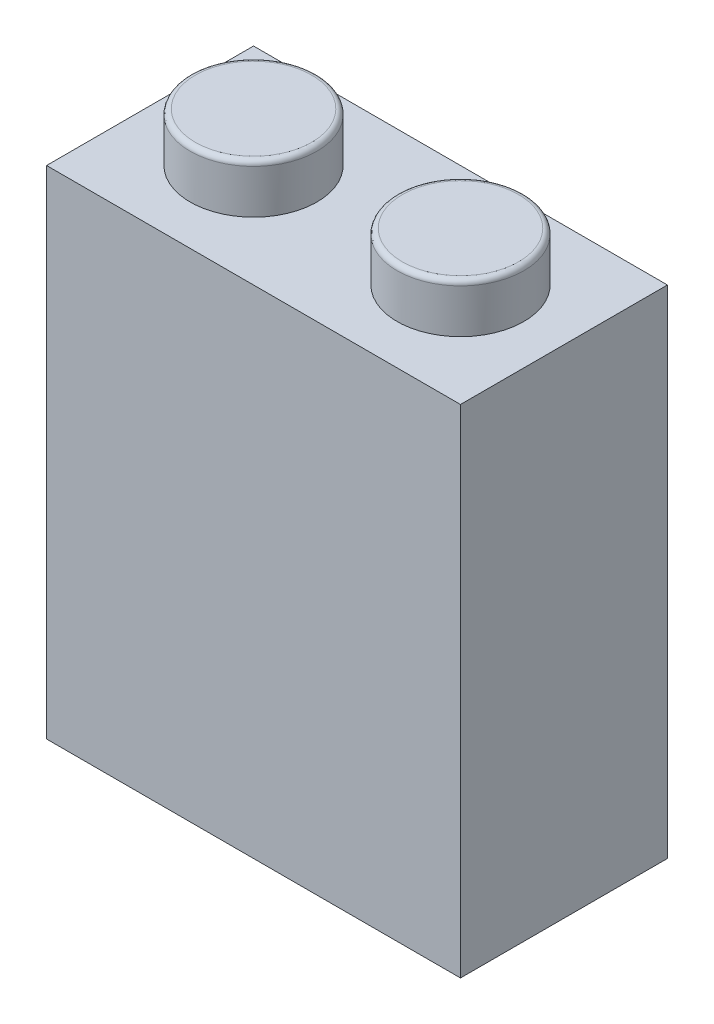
ISO-10303-21;
HEADER;
FILE_DESCRIPTION(('STEP AP214'),'2;1');
FILE_NAME('part.step','',(''),(''),'','','');
FILE_SCHEMA(('AUTOMOTIVE_DESIGN { 1 0 10303 214 1 1 1 1 }'));
ENDSEC;
DATA;
#1=APPLICATION_CONTEXT('core data for automotive mechanical design processes');
#2=APPLICATION_PROTOCOL_DEFINITION('international standard','automotive_design',2000,#1);
#3=PRODUCT_CONTEXT('',#1,'mechanical');
#4=PRODUCT('Part','Part','',(#3));
#5=PRODUCT_RELATED_PRODUCT_CATEGORY('part','',(#4));
#6=PRODUCT_DEFINITION_FORMATION('','',#4);
#7=PRODUCT_DEFINITION_CONTEXT('part definition',#1,'design');
#8=PRODUCT_DEFINITION('design','',#6,#7);
#9=PRODUCT_DEFINITION_SHAPE('','',#8);
#10=(LENGTH_UNIT() NAMED_UNIT(*) SI_UNIT(.MILLI.,.METRE.));
#11=(NAMED_UNIT(*) PLANE_ANGLE_UNIT() SI_UNIT($,.RADIAN.));
#12=(NAMED_UNIT(*) SI_UNIT($,.STERADIAN.) SOLID_ANGLE_UNIT());
#13=UNCERTAINTY_MEASURE_WITH_UNIT(LENGTH_MEASURE(1.E-05),#10,'distance_accuracy_value','');
#14=(GEOMETRIC_REPRESENTATION_CONTEXT(3) GLOBAL_UNCERTAINTY_ASSIGNED_CONTEXT((#13)) GLOBAL_UNIT_ASSIGNED_CONTEXT((#10,
#11,#12)) REPRESENTATION_CONTEXT('',''));
#15=CARTESIAN_POINT('',(0.,0.,0.));
#16=DIRECTION('',(0.,0.,1.));
#17=DIRECTION('',(1.,0.,0.));
#18=AXIS2_PLACEMENT_3D('',#15,#16,#17);
#19=CARTESIAN_POINT('',(1.6,18.2,6.4));
#20=DIRECTION('',(0.,-1.,0.));
#21=DIRECTION('',(0.,0.,-1.));
#22=AXIS2_PLACEMENT_3D('',#19,#20,#21);
#23=PLANE('',#22);
#24=CARTESIAN_POINT('',(12.,18.2,4.));
#25=DIRECTION('',(0.,-1.,0.));
#26=DIRECTION('',(0.,0.,-1.));
#27=AXIS2_PLACEMENT_3D('',#24,#25,#26);
#28=CIRCLE('',#27,1.6);
#29=CARTESIAN_POINT('',(12.,18.2,2.4));
#30=VERTEX_POINT('',#29);
#31=EDGE_CURVE('E317',#30,#30,#28,.T.);
#32=ORIENTED_EDGE('',*,*,#31,.F.);
#33=EDGE_LOOP('',(#32));
#34=FACE_BOUND('',#33,.T.);
#35=CARTESIAN_POINT('',(4.,18.2,4.));
#36=DIRECTION('',(0.,-1.,0.));
#37=DIRECTION('',(0.,0.,-1.));
#38=AXIS2_PLACEMENT_3D('',#35,#36,#37);
#39=CIRCLE('',#38,1.6);
#40=CARTESIAN_POINT('',(4.,18.2,2.4));
#41=VERTEX_POINT('',#40);
#42=EDGE_CURVE('E323',#41,#41,#39,.T.);
#43=ORIENTED_EDGE('',*,*,#42,.F.);
#44=EDGE_LOOP('',(#43));
#45=FACE_BOUND('',#44,.T.);
#46=DIRECTION('',(1.,0.,0.));
#47=VECTOR('',#46,1.);
#48=CARTESIAN_POINT('',(1.6,18.2,1.6));
#49=LINE('',#48,#47);
#50=CARTESIAN_POINT('',(7.2,18.2,1.6));
#51=VERTEX_POINT('',#50);
#52=CARTESIAN_POINT('',(9.,18.2,1.6));
#53=VERTEX_POINT('',#52);
#54=EDGE_CURVE('E347',#51,#53,#49,.T.);
#55=ORIENTED_EDGE('',*,*,#54,.T.);
#56=DIRECTION('',(0.,0.,-1.));
#57=VECTOR('',#56,1.);
#58=CARTESIAN_POINT('',(9.,18.2,1.6));
#59=LINE('',#58,#57);
#60=CARTESIAN_POINT('',(9.,18.2,3.05));
#61=VERTEX_POINT('',#60);
#62=EDGE_CURVE('E573',#61,#53,#59,.T.);
#63=ORIENTED_EDGE('',*,*,#62,.F.);
#64=DIRECTION('',(-1.,0.,0.));
#65=VECTOR('',#64,1.);
#66=CARTESIAN_POINT('',(9.,18.2,3.05));
#67=LINE('',#66,#65);
#68=CARTESIAN_POINT('',(9.411860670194,18.2,3.05));
#69=VERTEX_POINT('',#68);
#70=EDGE_CURVE('E581',#69,#61,#67,.T.);
#71=ORIENTED_EDGE('',*,*,#70,.F.);
#72=DIRECTION('',(-0.600225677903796,0.,0.799830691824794));
#73=VECTOR('',#72,1.);
#74=CARTESIAN_POINT('',(9.411860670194,18.2,3.05));
#75=LINE('',#74,#73);
#76=CARTESIAN_POINT('',(10.5,18.2,1.6));
#77=VERTEX_POINT('',#76);
#78=EDGE_CURVE('E568',#77,#69,#75,.T.);
#79=ORIENTED_EDGE('',*,*,#78,.F.);
#80=CARTESIAN_POINT('',(14.4,18.2,1.6));
#81=VERTEX_POINT('',#80);
#82=EDGE_CURVE('E216',#77,#81,#49,.T.);
#83=ORIENTED_EDGE('',*,*,#82,.T.);
#84=DIRECTION('',(0.,0.,1.));
#85=VECTOR('',#84,1.);
#86=CARTESIAN_POINT('',(14.4,18.2,6.4));
#87=LINE('',#86,#85);
#88=CARTESIAN_POINT('',(14.4,18.2,6.4));
#89=VERTEX_POINT('',#88);
#90=EDGE_CURVE('E346',#81,#89,#87,.T.);
#91=ORIENTED_EDGE('',*,*,#90,.T.);
#92=DIRECTION('',(-1.,0.,0.));
#93=VECTOR('',#92,1.);
#94=CARTESIAN_POINT('',(1.6,18.2,6.4));
#95=LINE('',#94,#93);
#96=CARTESIAN_POINT('',(10.5,18.2,6.4));
#97=VERTEX_POINT('',#96);
#98=EDGE_CURVE('E351',#89,#97,#95,.T.);
#99=ORIENTED_EDGE('',*,*,#98,.T.);
#100=DIRECTION('',(0.600225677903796,0.,0.799830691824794));
#101=VECTOR('',#100,1.);
#102=CARTESIAN_POINT('',(9.411860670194,18.2,4.95));
#103=LINE('',#102,#101);
#104=CARTESIAN_POINT('',(9.411860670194,18.2,4.95));
#105=VERTEX_POINT('',#104);
#106=EDGE_CURVE('E273',#105,#97,#103,.T.);
#107=ORIENTED_EDGE('',*,*,#106,.F.);
#108=DIRECTION('',(1.,0.,0.));
#109=VECTOR('',#108,1.);
#110=CARTESIAN_POINT('',(9.,18.2,4.95));
#111=LINE('',#110,#109);
#112=CARTESIAN_POINT('',(9.,18.2,4.95));
#113=VERTEX_POINT('',#112);
#114=EDGE_CURVE('E270',#113,#105,#111,.T.);
#115=ORIENTED_EDGE('',*,*,#114,.F.);
#116=DIRECTION('',(0.,0.,-1.));
#117=VECTOR('',#116,1.);
#118=CARTESIAN_POINT('',(9.,18.2,6.4));
#119=LINE('',#118,#117);
#120=CARTESIAN_POINT('',(9.,18.2,6.4));
#121=VERTEX_POINT('',#120);
#122=EDGE_CURVE('E267',#121,#113,#119,.T.);
#123=ORIENTED_EDGE('',*,*,#122,.F.);
#124=CARTESIAN_POINT('',(7.2,18.2,6.4));
#125=VERTEX_POINT('',#124);
#126=EDGE_CURVE('E355',#121,#125,#95,.T.);
#127=ORIENTED_EDGE('',*,*,#126,.T.);
#128=DIRECTION('',(0.,0.,1.));
#129=VECTOR('',#128,1.);
#130=CARTESIAN_POINT('',(7.2,18.2,6.4));
#131=LINE('',#130,#129);
#132=CARTESIAN_POINT('',(7.2,18.2,4.95));
#133=VERTEX_POINT('',#132);
#134=EDGE_CURVE('E297',#133,#125,#131,.T.);
#135=ORIENTED_EDGE('',*,*,#134,.F.);
#136=DIRECTION('',(1.,0.,0.));
#137=VECTOR('',#136,1.);
#138=CARTESIAN_POINT('',(7.2,18.2,4.95));
#139=LINE('',#138,#137);
#140=CARTESIAN_POINT('',(6.788139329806,18.2,4.95));
#141=VERTEX_POINT('',#140);
#142=EDGE_CURVE('E294',#141,#133,#139,.T.);
#143=ORIENTED_EDGE('',*,*,#142,.F.);
#144=DIRECTION('',(0.600225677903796,0.,-0.799830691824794));
#145=VECTOR('',#144,1.);
#146=CARTESIAN_POINT('',(6.788139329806,18.2,4.95));
#147=LINE('',#146,#145);
#148=CARTESIAN_POINT('',(5.7,18.2,6.4));
#149=VERTEX_POINT('',#148);
#150=EDGE_CURVE('E291',#149,#141,#147,.T.);
#151=ORIENTED_EDGE('',*,*,#150,.F.);
#152=CARTESIAN_POINT('',(1.6,18.2,6.4));
#153=VERTEX_POINT('',#152);
#154=EDGE_CURVE('E350',#149,#153,#95,.T.);
#155=ORIENTED_EDGE('',*,*,#154,.T.);
#156=DIRECTION('',(0.,0.,-1.));
#157=VECTOR('',#156,1.);
#158=CARTESIAN_POINT('',(1.6,18.2,6.4));
#159=LINE('',#158,#157);
#160=CARTESIAN_POINT('',(1.6,18.2,1.6));
#161=VERTEX_POINT('',#160);
#162=EDGE_CURVE('E340',#153,#161,#159,.T.);
#163=ORIENTED_EDGE('',*,*,#162,.T.);
#164=CARTESIAN_POINT('',(5.7,18.2,1.6));
#165=VERTEX_POINT('',#164);
#166=EDGE_CURVE('E343',#161,#165,#49,.T.);
#167=ORIENTED_EDGE('',*,*,#166,.T.);
#168=DIRECTION('',(-0.600225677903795,0.,-0.799830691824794));
#169=VECTOR('',#168,1.);
#170=CARTESIAN_POINT('',(6.788139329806,18.2,3.05));
#171=LINE('',#170,#169);
#172=CARTESIAN_POINT('',(6.788139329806,18.2,3.05));
#173=VERTEX_POINT('',#172);
#174=EDGE_CURVE('E249',#173,#165,#171,.T.);
#175=ORIENTED_EDGE('',*,*,#174,.F.);
#176=DIRECTION('',(-1.,0.,0.));
#177=VECTOR('',#176,1.);
#178=CARTESIAN_POINT('',(7.2,18.2,3.05));
#179=LINE('',#178,#177);
#180=CARTESIAN_POINT('',(7.2,18.2,3.05));
#181=VERTEX_POINT('',#180);
#182=EDGE_CURVE('E246',#181,#173,#179,.T.);
#183=ORIENTED_EDGE('',*,*,#182,.F.);
#184=DIRECTION('',(0.,0.,1.));
#185=VECTOR('',#184,1.);
#186=CARTESIAN_POINT('',(7.2,18.2,1.6));
#187=LINE('',#186,#185);
#188=EDGE_CURVE('E243',#51,#181,#187,.T.);
#189=ORIENTED_EDGE('',*,*,#188,.F.);
#190=EDGE_LOOP('',(#55,#63,#71,#79,#83,#91,#99,#107,#115,#123,#127,#135,#143,#151,#155,#163,
#167,#175,#183,#189));
#191=FACE_BOUND('',#190,.T.);
#192=ADVANCED_FACE('F26',(#34,#45,#191),#23,.T.);
#193=CARTESIAN_POINT('',(1.6,18.2,1.6));
#194=DIRECTION('',(0.,0.,-1.));
#195=DIRECTION('',(-1.,0.,0.));
#196=AXIS2_PLACEMENT_3D('',#193,#194,#195);
#197=PLANE('',#196);
#198=DIRECTION('',(0.,1.,0.));
#199=VECTOR('',#198,1.);
#200=CARTESIAN_POINT('',(9.,0.5,1.6));
#201=LINE('',#200,#199);
#202=CARTESIAN_POINT('',(9.,0.5,1.6));
#203=VERTEX_POINT('',#202);
#204=EDGE_CURVE('E220',#203,#53,#201,.T.);
#205=ORIENTED_EDGE('',*,*,#204,.T.);
#206=ORIENTED_EDGE('',*,*,#54,.F.);
#207=DIRECTION('',(0.,1.,0.));
#208=VECTOR('',#207,1.);
#209=CARTESIAN_POINT('',(7.2,0.5,1.6));
#210=LINE('',#209,#208);
#211=CARTESIAN_POINT('',(7.2,0.5,1.6));
#212=VERTEX_POINT('',#211);
#213=EDGE_CURVE('E258',#212,#51,#210,.T.);
#214=ORIENTED_EDGE('',*,*,#213,.F.);
#215=DIRECTION('',(1.,0.,0.));
#216=VECTOR('',#215,1.);
#217=CARTESIAN_POINT('',(5.7,0.5,1.6));
#218=LINE('',#217,#216);
#219=CARTESIAN_POINT('',(5.7,0.5,1.6));
#220=VERTEX_POINT('',#219);
#221=EDGE_CURVE('E256',#220,#212,#218,.T.);
#222=ORIENTED_EDGE('',*,*,#221,.F.);
#223=DIRECTION('',(0.,1.,0.));
#224=VECTOR('',#223,1.);
#225=CARTESIAN_POINT('',(5.7,0.5,1.6));
#226=LINE('',#225,#224);
#227=EDGE_CURVE('E260',#220,#165,#226,.T.);
#228=ORIENTED_EDGE('',*,*,#227,.T.);
#229=ORIENTED_EDGE('',*,*,#166,.F.);
#230=DIRECTION('',(0.,-1.,0.));
#231=VECTOR('',#230,1.);
#232=CARTESIAN_POINT('',(1.6,18.2,1.6));
#233=LINE('',#232,#231);
#234=CARTESIAN_POINT('',(1.6,0.,1.6));
#235=VERTEX_POINT('',#234);
#236=EDGE_CURVE('E354',#161,#235,#233,.T.);
#237=ORIENTED_EDGE('',*,*,#236,.T.);
#238=DIRECTION('',(1.,0.,0.));
#239=VECTOR('',#238,1.);
#240=CARTESIAN_POINT('',(1.6,0.,1.6));
#241=LINE('',#240,#239);
#242=CARTESIAN_POINT('',(14.4,0.,1.6));
#243=VERTEX_POINT('',#242);
#244=EDGE_CURVE('E331',#235,#243,#241,.T.);
#245=ORIENTED_EDGE('',*,*,#244,.T.);
#246=DIRECTION('',(0.,-1.,0.));
#247=VECTOR('',#246,1.);
#248=CARTESIAN_POINT('',(14.4,18.2,1.6));
#249=LINE('',#248,#247);
#250=EDGE_CURVE('E361',#81,#243,#249,.T.);
#251=ORIENTED_EDGE('',*,*,#250,.F.);
#252=ORIENTED_EDGE('',*,*,#82,.F.);
#253=DIRECTION('',(0.,1.,0.));
#254=VECTOR('',#253,1.);
#255=CARTESIAN_POINT('',(10.5,0.5,1.6));
#256=LINE('',#255,#254);
#257=CARTESIAN_POINT('',(10.5,0.5,1.6));
#258=VERTEX_POINT('',#257);
#259=EDGE_CURVE('E210',#258,#77,#256,.T.);
#260=ORIENTED_EDGE('',*,*,#259,.F.);
#261=DIRECTION('',(1.,0.,0.));
#262=VECTOR('',#261,1.);
#263=CARTESIAN_POINT('',(10.5,0.5,1.6));
#264=LINE('',#263,#262);
#265=EDGE_CURVE('E213',#203,#258,#264,.T.);
#266=ORIENTED_EDGE('',*,*,#265,.F.);
#267=EDGE_LOOP('',(#205,#206,#214,#222,#228,#229,#237,#245,#251,#252,#260,#266));
#268=FACE_BOUND('',#267,.T.);
#269=ADVANCED_FACE('F212',(#268),#197,.F.);
#270=CARTESIAN_POINT('',(1.6,18.2,6.4));
#271=DIRECTION('',(0.,0.,1.));
#272=DIRECTION('',(1.,0.,0.));
#273=AXIS2_PLACEMENT_3D('',#270,#271,#272);
#274=PLANE('',#273);
#275=DIRECTION('',(0.,1.,0.));
#276=VECTOR('',#275,1.);
#277=CARTESIAN_POINT('',(9.,0.5,6.4));
#278=LINE('',#277,#276);
#279=CARTESIAN_POINT('',(9.,0.5,6.4));
#280=VERTEX_POINT('',#279);
#281=EDGE_CURVE('E282',#280,#121,#278,.T.);
#282=ORIENTED_EDGE('',*,*,#281,.F.);
#283=DIRECTION('',(-1.,0.,0.));
#284=VECTOR('',#283,1.);
#285=CARTESIAN_POINT('',(10.5,0.5,6.4));
#286=LINE('',#285,#284);
#287=CARTESIAN_POINT('',(10.5,0.5,6.4));
#288=VERTEX_POINT('',#287);
#289=EDGE_CURVE('E280',#288,#280,#286,.T.);
#290=ORIENTED_EDGE('',*,*,#289,.F.);
#291=DIRECTION('',(0.,1.,0.));
#292=VECTOR('',#291,1.);
#293=CARTESIAN_POINT('',(10.5,0.5,6.4));
#294=LINE('',#293,#292);
#295=EDGE_CURVE('E284',#288,#97,#294,.T.);
#296=ORIENTED_EDGE('',*,*,#295,.T.);
#297=ORIENTED_EDGE('',*,*,#98,.F.);
#298=DIRECTION('',(0.,-1.,0.));
#299=VECTOR('',#298,1.);
#300=CARTESIAN_POINT('',(14.4,18.2,6.4));
#301=LINE('',#300,#299);
#302=CARTESIAN_POINT('',(14.4,0.,6.4));
#303=VERTEX_POINT('',#302);
#304=EDGE_CURVE('E359',#89,#303,#301,.T.);
#305=ORIENTED_EDGE('',*,*,#304,.T.);
#306=DIRECTION('',(-1.,0.,0.));
#307=VECTOR('',#306,1.);
#308=CARTESIAN_POINT('',(1.6,0.,6.4));
#309=LINE('',#308,#307);
#310=CARTESIAN_POINT('',(1.6,0.,6.4));
#311=VERTEX_POINT('',#310);
#312=EDGE_CURVE('E337',#303,#311,#309,.T.);
#313=ORIENTED_EDGE('',*,*,#312,.T.);
#314=DIRECTION('',(0.,-1.,0.));
#315=VECTOR('',#314,1.);
#316=CARTESIAN_POINT('',(1.6,18.2,6.4));
#317=LINE('',#316,#315);
#318=EDGE_CURVE('E356',#153,#311,#317,.T.);
#319=ORIENTED_EDGE('',*,*,#318,.F.);
#320=ORIENTED_EDGE('',*,*,#154,.F.);
#321=DIRECTION('',(0.,1.,0.));
#322=VECTOR('',#321,1.);
#323=CARTESIAN_POINT('',(5.7,0.5,6.4));
#324=LINE('',#323,#322);
#325=CARTESIAN_POINT('',(5.7,0.5,6.4));
#326=VERTEX_POINT('',#325);
#327=EDGE_CURVE('E315',#326,#149,#324,.T.);
#328=ORIENTED_EDGE('',*,*,#327,.F.);
#329=DIRECTION('',(-1.,0.,0.));
#330=VECTOR('',#329,1.);
#331=CARTESIAN_POINT('',(5.7,0.5,6.4));
#332=LINE('',#331,#330);
#333=CARTESIAN_POINT('',(7.2,0.5,6.4));
#334=VERTEX_POINT('',#333);
#335=EDGE_CURVE('E300',#334,#326,#332,.T.);
#336=ORIENTED_EDGE('',*,*,#335,.F.);
#337=DIRECTION('',(0.,1.,0.));
#338=VECTOR('',#337,1.);
#339=CARTESIAN_POINT('',(7.2,0.5,6.4));
#340=LINE('',#339,#338);
#341=EDGE_CURVE('E308',#334,#125,#340,.T.);
#342=ORIENTED_EDGE('',*,*,#341,.T.);
#343=ORIENTED_EDGE('',*,*,#126,.F.);
#344=EDGE_LOOP('',(#282,#290,#296,#297,#305,#313,#319,#320,#328,#336,#342,#343));
#345=FACE_BOUND('',#344,.T.);
#346=ADVANCED_FACE('F453',(#345),#274,.F.);
#347=CARTESIAN_POINT('',(0.,19.2,8.));
#348=DIRECTION('',(0.,-1.,0.));
#349=DIRECTION('',(0.,0.,-1.));
#350=AXIS2_PLACEMENT_3D('',#347,#348,#349);
#351=PLANE('',#350);
#352=CARTESIAN_POINT('',(12.,19.2,4.));
#353=DIRECTION('',(0.,-1.,0.));
#354=DIRECTION('',(0.,0.,-1.));
#355=AXIS2_PLACEMENT_3D('',#352,#353,#354);
#356=CIRCLE('',#355,2.45);
#357=CARTESIAN_POINT('',(12.,19.2,1.55));
#358=VERTEX_POINT('',#357);
#359=EDGE_CURVE('E394',#358,#358,#356,.F.);
#360=ORIENTED_EDGE('',*,*,#359,.F.);
#361=EDGE_LOOP('',(#360));
#362=FACE_BOUND('',#361,.T.);
#363=DIRECTION('',(-1.,0.,0.));
#364=VECTOR('',#363,1.);
#365=CARTESIAN_POINT('',(0.,19.2,0.));
#366=LINE('',#365,#364);
#367=CARTESIAN_POINT('',(16.,19.2,0.));
#368=VERTEX_POINT('',#367);
#369=CARTESIAN_POINT('',(0.,19.2,0.));
#370=VERTEX_POINT('',#369);
#371=EDGE_CURVE('E371',#368,#370,#366,.T.);
#372=ORIENTED_EDGE('',*,*,#371,.T.);
#373=DIRECTION('',(0.,0.,-1.));
#374=VECTOR('',#373,1.);
#375=CARTESIAN_POINT('',(0.,19.2,8.));
#376=LINE('',#375,#374);
#377=CARTESIAN_POINT('',(0.,19.2,8.));
#378=VERTEX_POINT('',#377);
#379=EDGE_CURVE('E382',#378,#370,#376,.T.);
#380=ORIENTED_EDGE('',*,*,#379,.F.);
#381=DIRECTION('',(-1.,0.,0.));
#382=VECTOR('',#381,1.);
#383=CARTESIAN_POINT('',(0.,19.2,8.));
#384=LINE('',#383,#382);
#385=CARTESIAN_POINT('',(16.,19.2,8.));
#386=VERTEX_POINT('',#385);
#387=EDGE_CURVE('E380',#386,#378,#384,.T.);
#388=ORIENTED_EDGE('',*,*,#387,.F.);
#389=DIRECTION('',(0.,0.,-1.));
#390=VECTOR('',#389,1.);
#391=CARTESIAN_POINT('',(16.,19.2,8.));
#392=LINE('',#391,#390);
#393=EDGE_CURVE('E385',#386,#368,#392,.T.);
#394=ORIENTED_EDGE('',*,*,#393,.T.);
#395=EDGE_LOOP('',(#372,#380,#388,#394));
#396=FACE_BOUND('',#395,.T.);
#397=CARTESIAN_POINT('',(4.,19.2,4.));
#398=DIRECTION('',(0.,-1.,0.));
#399=DIRECTION('',(0.,0.,-1.));
#400=AXIS2_PLACEMENT_3D('',#397,#398,#399);
#401=CIRCLE('',#400,2.45);
#402=CARTESIAN_POINT('',(4.,19.2,1.55));
#403=VERTEX_POINT('',#402);
#404=EDGE_CURVE('E397',#403,#403,#401,.F.);
#405=ORIENTED_EDGE('',*,*,#404,.F.);
#406=EDGE_LOOP('',(#405));
#407=FACE_BOUND('',#406,.T.);
#408=ADVANCED_FACE('F489',(#362,#396,#407),#351,.F.);
#409=CARTESIAN_POINT('',(0.,0.,8.));
#410=DIRECTION('',(1.,0.,0.));
#411=DIRECTION('',(0.,1.,0.));
#412=AXIS2_PLACEMENT_3D('',#409,#410,#411);
#413=PLANE('',#412);
#414=DIRECTION('',(0.,-1.,0.));
#415=VECTOR('',#414,1.);
#416=CARTESIAN_POINT('',(0.,0.,0.));
#417=LINE('',#416,#415);
#418=CARTESIAN_POINT('',(0.,0.,0.));
#419=VERTEX_POINT('',#418);
#420=EDGE_CURVE('E358',#370,#419,#417,.T.);
#421=ORIENTED_EDGE('',*,*,#420,.T.);
#422=DIRECTION('',(0.,0.,-1.));
#423=VECTOR('',#422,1.);
#424=CARTESIAN_POINT('',(0.,0.,8.));
#425=LINE('',#424,#423);
#426=CARTESIAN_POINT('',(0.,0.,8.));
#427=VERTEX_POINT('',#426);
#428=EDGE_CURVE('E391',#427,#419,#425,.T.);
#429=ORIENTED_EDGE('',*,*,#428,.F.);
#430=DIRECTION('',(0.,-1.,0.));
#431=VECTOR('',#430,1.);
#432=CARTESIAN_POINT('',(0.,0.,8.));
#433=LINE('',#432,#431);
#434=EDGE_CURVE('E373',#378,#427,#433,.T.);
#435=ORIENTED_EDGE('',*,*,#434,.F.);
#436=ORIENTED_EDGE('',*,*,#379,.T.);
#437=EDGE_LOOP('',(#421,#429,#435,#436));
#438=FACE_BOUND('',#437,.T.);
#439=ADVANCED_FACE('F28',(#438),#413,.F.);
#440=CARTESIAN_POINT('',(0.,0.,8.));
#441=DIRECTION('',(0.,1.,0.));
#442=DIRECTION('',(0.,0.,1.));
#443=AXIS2_PLACEMENT_3D('',#440,#441,#442);
#444=PLANE('',#443);
#445=ORIENTED_EDGE('',*,*,#244,.F.);
#446=DIRECTION('',(0.,0.,-1.));
#447=VECTOR('',#446,1.);
#448=CARTESIAN_POINT('',(1.6,0.,6.4));
#449=LINE('',#448,#447);
#450=EDGE_CURVE('E329',#311,#235,#449,.T.);
#451=ORIENTED_EDGE('',*,*,#450,.F.);
#452=ORIENTED_EDGE('',*,*,#312,.F.);
#453=DIRECTION('',(0.,0.,1.));
#454=VECTOR('',#453,1.);
#455=CARTESIAN_POINT('',(14.4,0.,6.4));
#456=LINE('',#455,#454);
#457=EDGE_CURVE('E334',#243,#303,#456,.T.);
#458=ORIENTED_EDGE('',*,*,#457,.F.);
#459=EDGE_LOOP('',(#445,#451,#452,#458));
#460=FACE_BOUND('',#459,.T.);
#461=DIRECTION('',(1.,0.,0.));
#462=VECTOR('',#461,1.);
#463=CARTESIAN_POINT('',(0.,0.,0.));
#464=LINE('',#463,#462);
#465=CARTESIAN_POINT('',(16.,0.,0.));
#466=VERTEX_POINT('',#465);
#467=EDGE_CURVE('E367',#419,#466,#464,.T.);
#468=ORIENTED_EDGE('',*,*,#467,.T.);
#469=DIRECTION('',(0.,0.,-1.));
#470=VECTOR('',#469,1.);
#471=CARTESIAN_POINT('',(16.,0.,8.));
#472=LINE('',#471,#470);
#473=CARTESIAN_POINT('',(16.,0.,8.));
#474=VERTEX_POINT('',#473);
#475=EDGE_CURVE('E388',#474,#466,#472,.T.);
#476=ORIENTED_EDGE('',*,*,#475,.F.);
#477=DIRECTION('',(1.,0.,0.));
#478=VECTOR('',#477,1.);
#479=CARTESIAN_POINT('',(0.,0.,8.));
#480=LINE('',#479,#478);
#481=EDGE_CURVE('E376',#427,#474,#480,.T.);
#482=ORIENTED_EDGE('',*,*,#481,.F.);
#483=ORIENTED_EDGE('',*,*,#428,.T.);
#484=EDGE_LOOP('',(#468,#476,#482,#483));
#485=FACE_BOUND('',#484,.T.);
#486=ADVANCED_FACE('F535',(#460,#485),#444,.F.);
#487=CARTESIAN_POINT('',(16.,0.,8.));
#488=DIRECTION('',(-1.,0.,0.));
#489=DIRECTION('',(0.,-1.,0.));
#490=AXIS2_PLACEMENT_3D('',#487,#488,#489);
#491=PLANE('',#490);
#492=DIRECTION('',(0.,1.,0.));
#493=VECTOR('',#492,1.);
#494=CARTESIAN_POINT('',(16.,0.,0.));
#495=LINE('',#494,#493);
#496=EDGE_CURVE('E369',#466,#368,#495,.T.);
#497=ORIENTED_EDGE('',*,*,#496,.T.);
#498=ORIENTED_EDGE('',*,*,#393,.F.);
#499=DIRECTION('',(0.,1.,0.));
#500=VECTOR('',#499,1.);
#501=CARTESIAN_POINT('',(16.,0.,8.));
#502=LINE('',#501,#500);
#503=EDGE_CURVE('E378',#474,#386,#502,.T.);
#504=ORIENTED_EDGE('',*,*,#503,.F.);
#505=ORIENTED_EDGE('',*,*,#475,.T.);
#506=EDGE_LOOP('',(#497,#498,#504,#505));
#507=FACE_BOUND('',#506,.T.);
#508=ADVANCED_FACE('F529',(#507),#491,.F.);
#509=CARTESIAN_POINT('',(0.,19.2,8.));
#510=DIRECTION('',(0.,0.,-1.));
#511=DIRECTION('',(-1.,0.,0.));
#512=AXIS2_PLACEMENT_3D('',#509,#510,#511);
#513=PLANE('',#512);
#514=ORIENTED_EDGE('',*,*,#434,.T.);
#515=ORIENTED_EDGE('',*,*,#481,.T.);
#516=ORIENTED_EDGE('',*,*,#503,.T.);
#517=ORIENTED_EDGE('',*,*,#387,.T.);
#518=EDGE_LOOP('',(#514,#515,#516,#517));
#519=FACE_BOUND('',#518,.T.);
#520=ADVANCED_FACE('F525',(#519),#513,.F.);
#521=CARTESIAN_POINT('',(0.,19.2,0.));
#522=DIRECTION('',(0.,0.,-1.));
#523=DIRECTION('',(-1.,0.,0.));
#524=AXIS2_PLACEMENT_3D('',#521,#522,#523);
#525=PLANE('',#524);
#526=ORIENTED_EDGE('',*,*,#420,.F.);
#527=ORIENTED_EDGE('',*,*,#371,.F.);
#528=ORIENTED_EDGE('',*,*,#496,.F.);
#529=ORIENTED_EDGE('',*,*,#467,.F.);
#530=EDGE_LOOP('',(#526,#527,#528,#529));
#531=FACE_BOUND('',#530,.T.);
#532=ADVANCED_FACE('F521',(#531),#525,.T.);
#533=CARTESIAN_POINT('',(12.,21.1,4.));
#534=DIRECTION('',(0.,-1.,0.));
#535=DIRECTION('',(0.,0.,-1.));
#536=AXIS2_PLACEMENT_3D('',#533,#534,#535);
#537=CYLINDRICAL_SURFACE('',#536,2.45);
#538=CARTESIAN_POINT('',(12.,20.9,4.));
#539=DIRECTION('',(0.,1.,0.));
#540=DIRECTION('',(0.,0.,1.));
#541=AXIS2_PLACEMENT_3D('',#538,#539,#540);
#542=CIRCLE('',#541,2.45);
#543=CARTESIAN_POINT('',(12.,20.9,1.55));
#544=VERTEX_POINT('',#543);
#545=EDGE_CURVE('E409',#544,#544,#542,.F.);
#546=CARTESIAN_POINT('',(12.,20.9,1.55));
#547=CARTESIAN_POINT('',(12.,20.8822916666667,1.55));
#548=CARTESIAN_POINT('',(12.,20.8645833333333,1.55));
#549=CARTESIAN_POINT('',(12.,20.8291666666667,1.55));
#550=CARTESIAN_POINT('',(12.,20.8114583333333,1.55));
#551=CARTESIAN_POINT('',(12.,20.7760416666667,1.55));
#552=CARTESIAN_POINT('',(12.,20.7583333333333,1.55));
#553=CARTESIAN_POINT('',(12.,20.7229166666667,1.55));
#554=CARTESIAN_POINT('',(12.,20.7052083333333,1.55));
#555=CARTESIAN_POINT('',(12.,20.6697916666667,1.55));
#556=CARTESIAN_POINT('',(12.,20.6520833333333,1.55));
#557=CARTESIAN_POINT('',(12.,20.6166666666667,1.55));
#558=CARTESIAN_POINT('',(12.,20.5989583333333,1.55));
#559=CARTESIAN_POINT('',(12.,20.5635416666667,1.55));
#560=CARTESIAN_POINT('',(12.,20.5458333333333,1.55));
#561=CARTESIAN_POINT('',(12.,20.5104166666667,1.55));
#562=CARTESIAN_POINT('',(12.,20.4927083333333,1.55));
#563=CARTESIAN_POINT('',(12.,20.4572916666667,1.55));
#564=CARTESIAN_POINT('',(12.,20.4395833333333,1.55));
#565=CARTESIAN_POINT('',(12.,20.4041666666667,1.55));
#566=CARTESIAN_POINT('',(12.,20.3864583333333,1.55));
#567=CARTESIAN_POINT('',(12.,20.3510416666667,1.55));
#568=CARTESIAN_POINT('',(12.,20.3333333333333,1.55));
#569=CARTESIAN_POINT('',(12.,20.2979166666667,1.55));
#570=CARTESIAN_POINT('',(12.,20.2802083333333,1.55));
#571=CARTESIAN_POINT('',(12.,20.2447916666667,1.55));
#572=CARTESIAN_POINT('',(12.,20.2270833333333,1.55));
#573=CARTESIAN_POINT('',(12.,20.1916666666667,1.55));
#574=CARTESIAN_POINT('',(12.,20.1739583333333,1.55));
#575=CARTESIAN_POINT('',(12.,20.1385416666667,1.55));
#576=CARTESIAN_POINT('',(12.,20.1208333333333,1.55));
#577=CARTESIAN_POINT('',(12.,20.0854166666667,1.55));
#578=CARTESIAN_POINT('',(12.,20.0677083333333,1.55));
#579=CARTESIAN_POINT('',(12.,20.0322916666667,1.55));
#580=CARTESIAN_POINT('',(12.,20.0145833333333,1.55));
#581=CARTESIAN_POINT('',(12.,19.9791666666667,1.55));
#582=CARTESIAN_POINT('',(12.,19.9614583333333,1.55));
#583=CARTESIAN_POINT('',(12.,19.9260416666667,1.55));
#584=CARTESIAN_POINT('',(12.,19.9083333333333,1.55));
#585=CARTESIAN_POINT('',(12.,19.8729166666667,1.55));
#586=CARTESIAN_POINT('',(12.,19.8552083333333,1.55));
#587=CARTESIAN_POINT('',(12.,19.8197916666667,1.55));
#588=CARTESIAN_POINT('',(12.,19.8020833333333,1.55));
#589=CARTESIAN_POINT('',(12.,19.7666666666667,1.55));
#590=CARTESIAN_POINT('',(12.,19.7489583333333,1.55));
#591=CARTESIAN_POINT('',(12.,19.7135416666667,1.55));
#592=CARTESIAN_POINT('',(12.,19.6958333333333,1.55));
#593=CARTESIAN_POINT('',(12.,19.6604166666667,1.55));
#594=CARTESIAN_POINT('',(12.,19.6427083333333,1.55));
#595=CARTESIAN_POINT('',(12.,19.6072916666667,1.55));
#596=CARTESIAN_POINT('',(12.,19.5895833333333,1.55));
#597=CARTESIAN_POINT('',(12.,19.5541666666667,1.55));
#598=CARTESIAN_POINT('',(12.,19.5364583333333,1.55));
#599=CARTESIAN_POINT('',(12.,19.5010416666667,1.55));
#600=CARTESIAN_POINT('',(12.,19.4833333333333,1.55));
#601=CARTESIAN_POINT('',(12.,19.4479166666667,1.55));
#602=CARTESIAN_POINT('',(12.,19.4302083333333,1.55));
#603=CARTESIAN_POINT('',(12.,19.3947916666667,1.55));
#604=CARTESIAN_POINT('',(12.,19.3770833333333,1.55));
#605=CARTESIAN_POINT('',(12.,19.3416666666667,1.55));
#606=CARTESIAN_POINT('',(12.,19.3239583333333,1.55));
#607=CARTESIAN_POINT('',(12.,19.2885416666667,1.55));
#608=CARTESIAN_POINT('',(12.,19.2708333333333,1.55));
#609=CARTESIAN_POINT('',(12.,19.2354166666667,1.55));
#610=CARTESIAN_POINT('',(12.,19.2177083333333,1.55));
#611=CARTESIAN_POINT('',(12.,19.2,1.55));
#612=B_SPLINE_CURVE_WITH_KNOTS('',3,(#546,#547,#548,#549,#550,#551,#552,#553,#554,#555,#556,
#557,#558,#559,#560,#561,#562,#563,#564,#565,#566,#567,#568,#569,#570,#571,#572,#573,#574,#575,
#576,#577,#578,#579,#580,#581,#582,#583,#584,#585,#586,#587,#588,#589,#590,#591,#592,#593,#594,
#595,#596,#597,#598,#599,#600,#601,#602,#603,#604,#605,#606,#607,#608,#609,#610,#611),
.UNSPECIFIED.,.F.,.F.,(4,2,2,2,2,2,2,2,2,2,2,2,2,2,2,2,2,2,2,2,2,2,2,2,2,2,2,2,2,2,2,2,4),(0.,
0.0531250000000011,0.106250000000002,0.159375,0.212500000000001,0.265625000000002,0.31875,
0.371875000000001,0.425000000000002,0.478124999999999,0.53125,0.584375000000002,
0.637499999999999,0.690625,0.743750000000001,0.796874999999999,0.85,0.903125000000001,
0.956249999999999,1.009375,1.0625,1.115625,1.16875,1.221875,1.275,1.328125,1.38125,1.434375,
1.4875,1.540625,1.59375,1.646875,1.7),.UNSPECIFIED.);
#613=EDGE_CURVE('BSEAM517',#544,#358,#612,.T.);
#614=ORIENTED_EDGE('',*,*,#545,.T.);
#615=ORIENTED_EDGE('',*,*,#359,.T.);
#616=ORIENTED_EDGE('',*,*,#613,.T.);
#617=ORIENTED_EDGE('',*,*,#613,.F.);
#618=EDGE_LOOP('',(#614,#616,#615,#617));
#619=FACE_BOUND('',#618,.T.);
#620=ADVANCED_FACE('F517',(#619),#537,.T.);
#621=CARTESIAN_POINT('',(12.,21.1,4.));
#622=DIRECTION('',(0.,1.,0.));
#623=DIRECTION('',(0.,0.,1.));
#624=AXIS2_PLACEMENT_3D('',#621,#622,#623);
#625=PLANE('',#624);
#626=CARTESIAN_POINT('',(12.,21.1,4.));
#627=DIRECTION('',(0.,1.,0.));
#628=DIRECTION('',(0.,0.,1.));
#629=AXIS2_PLACEMENT_3D('',#626,#627,#628);
#630=CIRCLE('',#629,2.25);
#631=CARTESIAN_POINT('',(12.,21.1,6.25));
#632=VERTEX_POINT('',#631);
#633=EDGE_CURVE('E406',#632,#632,#630,.T.);
#634=ORIENTED_EDGE('',*,*,#633,.T.);
#635=EDGE_LOOP('',(#634));
#636=FACE_BOUND('',#635,.T.);
#637=ADVANCED_FACE('F513',(#636),#625,.T.);
#638=CARTESIAN_POINT('',(4.,21.1,4.));
#639=DIRECTION('',(0.,-1.,0.));
#640=DIRECTION('',(0.,0.,-1.));
#641=AXIS2_PLACEMENT_3D('',#638,#639,#640);
#642=CYLINDRICAL_SURFACE('',#641,2.45);
#643=CARTESIAN_POINT('',(4.,20.9,4.));
#644=DIRECTION('',(0.,1.,0.));
#645=DIRECTION('',(0.,0.,1.));
#646=AXIS2_PLACEMENT_3D('',#643,#644,#645);
#647=CIRCLE('',#646,2.45);
#648=CARTESIAN_POINT('',(4.,20.9,1.55));
#649=VERTEX_POINT('',#648);
#650=EDGE_CURVE('E403',#649,#649,#647,.F.);
#651=CARTESIAN_POINT('',(4.,20.9,1.55));
#652=CARTESIAN_POINT('',(4.,20.8822916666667,1.55));
#653=CARTESIAN_POINT('',(4.,20.8645833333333,1.55));
#654=CARTESIAN_POINT('',(4.,20.8291666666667,1.55));
#655=CARTESIAN_POINT('',(4.,20.8114583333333,1.55));
#656=CARTESIAN_POINT('',(4.,20.7760416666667,1.55));
#657=CARTESIAN_POINT('',(4.,20.7583333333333,1.55));
#658=CARTESIAN_POINT('',(4.,20.7229166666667,1.55));
#659=CARTESIAN_POINT('',(4.,20.7052083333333,1.55));
#660=CARTESIAN_POINT('',(4.,20.6697916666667,1.55));
#661=CARTESIAN_POINT('',(4.,20.6520833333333,1.55));
#662=CARTESIAN_POINT('',(4.,20.6166666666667,1.55));
#663=CARTESIAN_POINT('',(4.,20.5989583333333,1.55));
#664=CARTESIAN_POINT('',(4.,20.5635416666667,1.55));
#665=CARTESIAN_POINT('',(4.,20.5458333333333,1.55));
#666=CARTESIAN_POINT('',(4.,20.5104166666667,1.55));
#667=CARTESIAN_POINT('',(4.,20.4927083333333,1.55));
#668=CARTESIAN_POINT('',(4.,20.4572916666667,1.55));
#669=CARTESIAN_POINT('',(4.,20.4395833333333,1.55));
#670=CARTESIAN_POINT('',(4.,20.4041666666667,1.55));
#671=CARTESIAN_POINT('',(4.,20.3864583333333,1.55));
#672=CARTESIAN_POINT('',(4.,20.3510416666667,1.55));
#673=CARTESIAN_POINT('',(4.,20.3333333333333,1.55));
#674=CARTESIAN_POINT('',(4.,20.2979166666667,1.55));
#675=CARTESIAN_POINT('',(4.,20.2802083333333,1.55));
#676=CARTESIAN_POINT('',(4.,20.2447916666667,1.55));
#677=CARTESIAN_POINT('',(4.,20.2270833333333,1.55));
#678=CARTESIAN_POINT('',(4.,20.1916666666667,1.55));
#679=CARTESIAN_POINT('',(4.,20.1739583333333,1.55));
#680=CARTESIAN_POINT('',(4.,20.1385416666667,1.55));
#681=CARTESIAN_POINT('',(4.,20.1208333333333,1.55));
#682=CARTESIAN_POINT('',(4.,20.0854166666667,1.55));
#683=CARTESIAN_POINT('',(4.,20.0677083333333,1.55));
#684=CARTESIAN_POINT('',(4.,20.0322916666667,1.55));
#685=CARTESIAN_POINT('',(4.,20.0145833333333,1.55));
#686=CARTESIAN_POINT('',(4.,19.9791666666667,1.55));
#687=CARTESIAN_POINT('',(4.,19.9614583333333,1.55));
#688=CARTESIAN_POINT('',(4.,19.9260416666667,1.55));
#689=CARTESIAN_POINT('',(4.,19.9083333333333,1.55));
#690=CARTESIAN_POINT('',(4.,19.8729166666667,1.55));
#691=CARTESIAN_POINT('',(4.,19.8552083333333,1.55));
#692=CARTESIAN_POINT('',(4.,19.8197916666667,1.55));
#693=CARTESIAN_POINT('',(4.,19.8020833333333,1.55));
#694=CARTESIAN_POINT('',(4.,19.7666666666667,1.55));
#695=CARTESIAN_POINT('',(4.,19.7489583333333,1.55));
#696=CARTESIAN_POINT('',(4.,19.7135416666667,1.55));
#697=CARTESIAN_POINT('',(4.,19.6958333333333,1.55));
#698=CARTESIAN_POINT('',(4.,19.6604166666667,1.55));
#699=CARTESIAN_POINT('',(4.,19.6427083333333,1.55));
#700=CARTESIAN_POINT('',(4.,19.6072916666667,1.55));
#701=CARTESIAN_POINT('',(4.,19.5895833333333,1.55));
#702=CARTESIAN_POINT('',(4.,19.5541666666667,1.55));
#703=CARTESIAN_POINT('',(4.,19.5364583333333,1.55));
#704=CARTESIAN_POINT('',(4.,19.5010416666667,1.55));
#705=CARTESIAN_POINT('',(4.,19.4833333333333,1.55));
#706=CARTESIAN_POINT('',(4.,19.4479166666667,1.55));
#707=CARTESIAN_POINT('',(4.,19.4302083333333,1.55));
#708=CARTESIAN_POINT('',(4.,19.3947916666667,1.55));
#709=CARTESIAN_POINT('',(4.,19.3770833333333,1.55));
#710=CARTESIAN_POINT('',(4.,19.3416666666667,1.55));
#711=CARTESIAN_POINT('',(4.,19.3239583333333,1.55));
#712=CARTESIAN_POINT('',(4.,19.2885416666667,1.55));
#713=CARTESIAN_POINT('',(4.,19.2708333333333,1.55));
#714=CARTESIAN_POINT('',(4.,19.2354166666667,1.55));
#715=CARTESIAN_POINT('',(4.,19.2177083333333,1.55));
#716=CARTESIAN_POINT('',(4.,19.2,1.55));
#717=B_SPLINE_CURVE_WITH_KNOTS('',3,(#651,#652,#653,#654,#655,#656,#657,#658,#659,#660,#661,
#662,#663,#664,#665,#666,#667,#668,#669,#670,#671,#672,#673,#674,#675,#676,#677,#678,#679,#680,
#681,#682,#683,#684,#685,#686,#687,#688,#689,#690,#691,#692,#693,#694,#695,#696,#697,#698,#699,
#700,#701,#702,#703,#704,#705,#706,#707,#708,#709,#710,#711,#712,#713,#714,#715,#716),
.UNSPECIFIED.,.F.,.F.,(4,2,2,2,2,2,2,2,2,2,2,2,2,2,2,2,2,2,2,2,2,2,2,2,2,2,2,2,2,2,2,2,4),(0.,
0.0531250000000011,0.106250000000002,0.159375,0.212500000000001,0.265625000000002,0.31875,
0.371875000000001,0.425000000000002,0.478124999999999,0.53125,0.584375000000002,
0.637499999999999,0.690625,0.743750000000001,0.796874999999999,0.85,0.903125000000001,
0.956249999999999,1.009375,1.0625,1.115625,1.16875,1.221875,1.275,1.328125,1.38125,1.434375,
1.4875,1.540625,1.59375,1.646875,1.7),.UNSPECIFIED.);
#718=EDGE_CURVE('BSEAM509',#649,#403,#717,.T.);
#719=ORIENTED_EDGE('',*,*,#650,.T.);
#720=ORIENTED_EDGE('',*,*,#404,.T.);
#721=ORIENTED_EDGE('',*,*,#718,.T.);
#722=ORIENTED_EDGE('',*,*,#718,.F.);
#723=EDGE_LOOP('',(#719,#721,#720,#722));
#724=FACE_BOUND('',#723,.T.);
#725=ADVANCED_FACE('F509',(#724),#642,.T.);
#726=CARTESIAN_POINT('',(4.,21.1,4.));
#727=DIRECTION('',(0.,1.,0.));
#728=DIRECTION('',(0.,0.,1.));
#729=AXIS2_PLACEMENT_3D('',#726,#727,#728);
#730=PLANE('',#729);
#731=CARTESIAN_POINT('',(4.,21.1,4.));
#732=DIRECTION('',(0.,1.,0.));
#733=DIRECTION('',(0.,0.,1.));
#734=AXIS2_PLACEMENT_3D('',#731,#732,#733);
#735=CIRCLE('',#734,2.25);
#736=CARTESIAN_POINT('',(4.,21.1,6.25));
#737=VERTEX_POINT('',#736);
#738=EDGE_CURVE('E400',#737,#737,#735,.T.);
#739=ORIENTED_EDGE('',*,*,#738,.T.);
#740=EDGE_LOOP('',(#739));
#741=FACE_BOUND('',#740,.T.);
#742=ADVANCED_FACE('F505',(#741),#730,.T.);
#743=CARTESIAN_POINT('',(4.,20.9,4.));
#744=DIRECTION('',(0.,1.,0.));
#745=DIRECTION('',(0.,0.,1.));
#746=AXIS2_PLACEMENT_3D('',#743,#744,#745);
#747=TOROIDAL_SURFACE('',#746,2.25,0.2);
#748=ORIENTED_EDGE('',*,*,#650,.F.);
#749=EDGE_LOOP('',(#748));
#750=FACE_BOUND('',#749,.T.);
#751=ORIENTED_EDGE('',*,*,#738,.F.);
#752=EDGE_LOOP('',(#751));
#753=FACE_BOUND('',#752,.T.);
#754=ADVANCED_FACE('F501',(#750,#753),#747,.T.);
#755=CARTESIAN_POINT('',(12.,20.9,4.));
#756=DIRECTION('',(0.,1.,0.));
#757=DIRECTION('',(0.,0.,1.));
#758=AXIS2_PLACEMENT_3D('',#755,#756,#757);
#759=TOROIDAL_SURFACE('',#758,2.25,0.2);
#760=ORIENTED_EDGE('',*,*,#545,.F.);
#761=EDGE_LOOP('',(#760));
#762=FACE_BOUND('',#761,.T.);
#763=ORIENTED_EDGE('',*,*,#633,.F.);
#764=EDGE_LOOP('',(#763));
#765=FACE_BOUND('',#764,.T.);
#766=ADVANCED_FACE('F497',(#762,#765),#759,.T.);
#767=CARTESIAN_POINT('',(1.6,18.2,6.4));
#768=DIRECTION('',(-1.,0.,0.));
#769=DIRECTION('',(0.,0.,1.));
#770=AXIS2_PLACEMENT_3D('',#767,#768,#769);
#771=PLANE('',#770);
#772=ORIENTED_EDGE('',*,*,#450,.T.);
#773=ORIENTED_EDGE('',*,*,#236,.F.);
#774=ORIENTED_EDGE('',*,*,#162,.F.);
#775=ORIENTED_EDGE('',*,*,#318,.T.);
#776=EDGE_LOOP('',(#772,#773,#774,#775));
#777=FACE_BOUND('',#776,.T.);
#778=ADVANCED_FACE('F492',(#777),#771,.F.);
#779=CARTESIAN_POINT('',(14.4,18.2,6.4));
#780=DIRECTION('',(1.,0.,0.));
#781=DIRECTION('',(0.,0.,-1.));
#782=AXIS2_PLACEMENT_3D('',#779,#780,#781);
#783=PLANE('',#782);
#784=ORIENTED_EDGE('',*,*,#457,.T.);
#785=ORIENTED_EDGE('',*,*,#304,.F.);
#786=ORIENTED_EDGE('',*,*,#90,.F.);
#787=ORIENTED_EDGE('',*,*,#250,.T.);
#788=EDGE_LOOP('',(#784,#785,#786,#787));
#789=FACE_BOUND('',#788,.T.);
#790=ADVANCED_FACE('F490',(#789),#783,.F.);
#791=CARTESIAN_POINT('',(4.,20.,4.));
#792=DIRECTION('',(0.,-1.,0.));
#793=DIRECTION('',(0.,0.,-1.));
#794=AXIS2_PLACEMENT_3D('',#791,#792,#793);
#795=CYLINDRICAL_SURFACE('',#794,1.6);
#796=CARTESIAN_POINT('',(4.,20.,4.));
#797=DIRECTION('',(0.,-1.,0.));
#798=DIRECTION('',(0.,0.,-1.));
#799=AXIS2_PLACEMENT_3D('',#796,#797,#798);
#800=CIRCLE('',#799,1.6);
#801=CARTESIAN_POINT('',(4.,20.,2.4));
#802=VERTEX_POINT('',#801);
#803=EDGE_CURVE('E326',#802,#802,#800,.T.);
#804=ORIENTED_EDGE('',*,*,#803,.F.);
#805=EDGE_LOOP('',(#804));
#806=FACE_BOUND('',#805,.T.);
#807=ORIENTED_EDGE('',*,*,#42,.T.);
#808=EDGE_LOOP('',(#807));
#809=FACE_BOUND('',#808,.T.);
#810=ADVANCED_FACE('F485',(#806,#809),#795,.F.);
#811=CARTESIAN_POINT('',(4.,20.,4.));
#812=DIRECTION('',(0.,-1.,0.));
#813=DIRECTION('',(0.,0.,-1.));
#814=AXIS2_PLACEMENT_3D('',#811,#812,#813);
#815=PLANE('',#814);
#816=ORIENTED_EDGE('',*,*,#803,.T.);
#817=EDGE_LOOP('',(#816));
#818=FACE_BOUND('',#817,.T.);
#819=ADVANCED_FACE('F650',(#818),#815,.T.);
#820=CARTESIAN_POINT('',(12.,20.,4.));
#821=DIRECTION('',(0.,-1.,0.));
#822=DIRECTION('',(0.,0.,-1.));
#823=AXIS2_PLACEMENT_3D('',#820,#821,#822);
#824=CYLINDRICAL_SURFACE('',#823,1.6);
#825=CARTESIAN_POINT('',(12.,20.,4.));
#826=DIRECTION('',(0.,-1.,0.));
#827=DIRECTION('',(0.,0.,-1.));
#828=AXIS2_PLACEMENT_3D('',#825,#826,#827);
#829=CIRCLE('',#828,1.6);
#830=CARTESIAN_POINT('',(12.,20.,2.4));
#831=VERTEX_POINT('',#830);
#832=EDGE_CURVE('E320',#831,#831,#829,.T.);
#833=ORIENTED_EDGE('',*,*,#832,.F.);
#834=EDGE_LOOP('',(#833));
#835=FACE_BOUND('',#834,.T.);
#836=ORIENTED_EDGE('',*,*,#31,.T.);
#837=EDGE_LOOP('',(#836));
#838=FACE_BOUND('',#837,.T.);
#839=ADVANCED_FACE('F647',(#835,#838),#824,.F.);
#840=CARTESIAN_POINT('',(12.,20.,4.));
#841=DIRECTION('',(0.,-1.,0.));
#842=DIRECTION('',(0.,0.,-1.));
#843=AXIS2_PLACEMENT_3D('',#840,#841,#842);
#844=PLANE('',#843);
#845=ORIENTED_EDGE('',*,*,#832,.T.);
#846=EDGE_LOOP('',(#845));
#847=FACE_BOUND('',#846,.T.);
#848=ADVANCED_FACE('F645',(#847),#844,.T.);
#849=CARTESIAN_POINT('',(6.788139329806,0.5,4.95));
#850=DIRECTION('',(0.799830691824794,0.,0.600225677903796));
#851=DIRECTION('',(0.600225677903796,0.,-0.799830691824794));
#852=AXIS2_PLACEMENT_3D('',#849,#850,#851);
#853=PLANE('',#852);
#854=DIRECTION('',(0.,1.,0.));
#855=VECTOR('',#854,1.);
#856=CARTESIAN_POINT('',(6.788139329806,0.5,4.95));
#857=LINE('',#856,#855);
#858=CARTESIAN_POINT('',(6.788139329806,1.5,4.95));
#859=VERTEX_POINT('',#858);
#860=EDGE_CURVE('E313',#859,#141,#857,.T.);
#861=ORIENTED_EDGE('',*,*,#860,.F.);
#862=DIRECTION('',(0.498387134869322,0.557267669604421,-0.66412574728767));
#863=VECTOR('',#862,1.);
#864=CARTESIAN_POINT('',(6.21824567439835,0.862777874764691,5.7094117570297));
#865=LINE('',#864,#863);
#866=CARTESIAN_POINT('',(5.89379867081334,0.5,6.14175359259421));
#867=VERTEX_POINT('',#866);
#868=EDGE_CURVE('E11',#859,#867,#865,.F.);
#869=ORIENTED_EDGE('',*,*,#868,.T.);
#870=DIRECTION('',(0.600225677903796,0.,-0.799830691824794));
#871=VECTOR('',#870,1.);
#872=CARTESIAN_POINT('',(6.788139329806,0.5,4.95));
#873=LINE('',#872,#871);
#874=EDGE_CURVE('E303',#326,#867,#873,.T.);
#875=ORIENTED_EDGE('',*,*,#874,.F.);
#876=ORIENTED_EDGE('',*,*,#327,.T.);
#877=ORIENTED_EDGE('',*,*,#150,.T.);
#878=EDGE_LOOP('',(#861,#869,#875,#876,#877));
#879=FACE_BOUND('',#878,.T.);
#880=ADVANCED_FACE('F458',(#879),#853,.F.);
#881=CARTESIAN_POINT('',(7.2,0.5,4.95));
#882=DIRECTION('',(0.,0.,1.));
#883=DIRECTION('',(1.,0.,0.));
#884=AXIS2_PLACEMENT_3D('',#881,#882,#883);
#885=PLANE('',#884);
#886=DIRECTION('',(0.,1.,0.));
#887=VECTOR('',#886,1.);
#888=CARTESIAN_POINT('',(7.2,0.5,4.95));
#889=LINE('',#888,#887);
#890=CARTESIAN_POINT('',(7.2,1.5,4.95));
#891=VERTEX_POINT('',#890);
#892=EDGE_CURVE('E311',#891,#133,#889,.T.);
#893=ORIENTED_EDGE('',*,*,#892,.F.);
#894=DIRECTION('',(-1.,0.,0.));
#895=VECTOR('',#894,1.);
#896=CARTESIAN_POINT('',(7.2,1.5,4.95));
#897=LINE('',#896,#895);
#898=EDGE_CURVE('E34',#891,#859,#897,.T.);
#899=ORIENTED_EDGE('',*,*,#898,.T.);
#900=ORIENTED_EDGE('',*,*,#860,.T.);
#901=ORIENTED_EDGE('',*,*,#142,.T.);
#902=EDGE_LOOP('',(#893,#899,#900,#901));
#903=FACE_BOUND('',#902,.T.);
#904=ADVANCED_FACE('F462',(#903),#885,.F.);
#905=CARTESIAN_POINT('',(7.2,0.5,6.4));
#906=DIRECTION('',(-1.,0.,0.));
#907=DIRECTION('',(0.,0.,1.));
#908=AXIS2_PLACEMENT_3D('',#905,#906,#907);
#909=PLANE('',#908);
#910=DIRECTION('',(0.,0.,1.));
#911=VECTOR('',#910,1.);
#912=CARTESIAN_POINT('',(7.2,0.5,6.4));
#913=LINE('',#912,#911);
#914=CARTESIAN_POINT('',(7.2,0.5,6.14175359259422));
#915=VERTEX_POINT('',#914);
#916=EDGE_CURVE('E306',#915,#334,#913,.T.);
#917=ORIENTED_EDGE('',*,*,#916,.F.);
#918=DIRECTION('',(0.,-0.64278760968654,0.766044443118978));
#919=VECTOR('',#918,1.);
#920=CARTESIAN_POINT('',(7.2,0.5,6.14175359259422));
#921=LINE('',#920,#919);
#922=EDGE_CURVE('E48',#915,#891,#921,.F.);
#923=ORIENTED_EDGE('',*,*,#922,.T.);
#924=ORIENTED_EDGE('',*,*,#892,.T.);
#925=ORIENTED_EDGE('',*,*,#134,.T.);
#926=ORIENTED_EDGE('',*,*,#341,.F.);
#927=EDGE_LOOP('',(#917,#923,#924,#925,#926));
#928=FACE_BOUND('',#927,.T.);
#929=ADVANCED_FACE('F446',(#928),#909,.F.);
#930=CARTESIAN_POINT('',(7.2,0.5,6.4));
#931=DIRECTION('',(0.,1.,0.));
#932=DIRECTION('',(0.,0.,1.));
#933=AXIS2_PLACEMENT_3D('',#930,#931,#932);
#934=PLANE('',#933);
#935=ORIENTED_EDGE('',*,*,#874,.T.);
#936=DIRECTION('',(1.,0.,0.));
#937=VECTOR('',#936,1.);
#938=CARTESIAN_POINT('',(7.2,0.5,6.14175359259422));
#939=LINE('',#938,#937);
#940=EDGE_CURVE('E437',#867,#915,#939,.T.);
#941=ORIENTED_EDGE('',*,*,#940,.T.);
#942=ORIENTED_EDGE('',*,*,#916,.T.);
#943=ORIENTED_EDGE('',*,*,#335,.T.);
#944=EDGE_LOOP('',(#935,#941,#942,#943));
#945=FACE_BOUND('',#944,.T.);
#946=ADVANCED_FACE('F442',(#945),#934,.F.);
#947=CARTESIAN_POINT('',(9.,0.5,6.4));
#948=DIRECTION('',(1.,0.,0.));
#949=DIRECTION('',(0.,0.,-1.));
#950=AXIS2_PLACEMENT_3D('',#947,#948,#949);
#951=PLANE('',#950);
#952=DIRECTION('',(0.,1.,0.));
#953=VECTOR('',#952,1.);
#954=CARTESIAN_POINT('',(9.,0.5,4.95));
#955=LINE('',#954,#953);
#956=CARTESIAN_POINT('',(9.,1.5,4.95));
#957=VERTEX_POINT('',#956);
#958=EDGE_CURVE('E289',#957,#113,#955,.T.);
#959=ORIENTED_EDGE('',*,*,#958,.F.);
#960=DIRECTION('',(0.,0.64278760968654,-0.766044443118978));
#961=VECTOR('',#960,1.);
#962=CARTESIAN_POINT('',(9.,0.5,6.14175359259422));
#963=LINE('',#962,#961);
#964=CARTESIAN_POINT('',(9.,0.5,6.14175359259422));
#965=VERTEX_POINT('',#964);
#966=EDGE_CURVE('E435',#957,#965,#963,.F.);
#967=ORIENTED_EDGE('',*,*,#966,.T.);
#968=DIRECTION('',(0.,0.,-1.));
#969=VECTOR('',#968,1.);
#970=CARTESIAN_POINT('',(9.,0.5,6.4));
#971=LINE('',#970,#969);
#972=EDGE_CURVE('E275',#280,#965,#971,.T.);
#973=ORIENTED_EDGE('',*,*,#972,.F.);
#974=ORIENTED_EDGE('',*,*,#281,.T.);
#975=ORIENTED_EDGE('',*,*,#122,.T.);
#976=EDGE_LOOP('',(#959,#967,#973,#974,#975));
#977=FACE_BOUND('',#976,.T.);
#978=ADVANCED_FACE('F632',(#977),#951,.F.);
#979=CARTESIAN_POINT('',(9.,0.5,4.95));
#980=DIRECTION('',(0.,0.,1.));
#981=DIRECTION('',(1.,0.,0.));
#982=AXIS2_PLACEMENT_3D('',#979,#980,#981);
#983=PLANE('',#982);
#984=DIRECTION('',(0.,1.,0.));
#985=VECTOR('',#984,1.);
#986=CARTESIAN_POINT('',(9.411860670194,0.5,4.95));
#987=LINE('',#986,#985);
#988=CARTESIAN_POINT('',(9.411860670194,1.5,4.95));
#989=VERTEX_POINT('',#988);
#990=EDGE_CURVE('E287',#989,#105,#987,.T.);
#991=ORIENTED_EDGE('',*,*,#990,.F.);
#992=DIRECTION('',(-1.,0.,0.));
#993=VECTOR('',#992,1.);
#994=CARTESIAN_POINT('',(9.,1.5,4.95));
#995=LINE('',#994,#993);
#996=EDGE_CURVE('E433',#989,#957,#995,.T.);
#997=ORIENTED_EDGE('',*,*,#996,.T.);
#998=ORIENTED_EDGE('',*,*,#958,.T.);
#999=ORIENTED_EDGE('',*,*,#114,.T.);
#1000=EDGE_LOOP('',(#991,#997,#998,#999));
#1001=FACE_BOUND('',#1000,.T.);
#1002=ADVANCED_FACE('F628',(#1001),#983,.F.);
#1003=CARTESIAN_POINT('',(9.411860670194,0.5,4.95));
#1004=DIRECTION('',(-0.799830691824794,0.,0.600225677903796));
#1005=DIRECTION('',(0.600225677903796,0.,0.799830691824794));
#1006=AXIS2_PLACEMENT_3D('',#1003,#1004,#1005);
#1007=PLANE('',#1006);
#1008=DIRECTION('',(0.600225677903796,0.,0.799830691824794));
#1009=VECTOR('',#1008,1.);
#1010=CARTESIAN_POINT('',(9.411860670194,0.5,4.95));
#1011=LINE('',#1010,#1009);
#1012=CARTESIAN_POINT('',(10.3062013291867,0.5,6.14175359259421));
#1013=VERTEX_POINT('',#1012);
#1014=EDGE_CURVE('E278',#1013,#288,#1011,.T.);
#1015=ORIENTED_EDGE('',*,*,#1014,.F.);
#1016=DIRECTION('',(0.498387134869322,-0.557267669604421,0.66412574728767));
#1017=VECTOR('',#1016,1.);
#1018=CARTESIAN_POINT('',(9.98175432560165,0.862777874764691,5.7094117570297));
#1019=LINE('',#1018,#1017);
#1020=EDGE_CURVE('E431',#1013,#989,#1019,.F.);
#1021=ORIENTED_EDGE('',*,*,#1020,.T.);
#1022=ORIENTED_EDGE('',*,*,#990,.T.);
#1023=ORIENTED_EDGE('',*,*,#106,.T.);
#1024=ORIENTED_EDGE('',*,*,#295,.F.);
#1025=EDGE_LOOP('',(#1015,#1021,#1022,#1023,#1024));
#1026=FACE_BOUND('',#1025,.T.);
#1027=ADVANCED_FACE('F624',(#1026),#1007,.F.);
#1028=CARTESIAN_POINT('',(9.,0.5,6.4));
#1029=DIRECTION('',(0.,1.,0.));
#1030=DIRECTION('',(0.,0.,1.));
#1031=AXIS2_PLACEMENT_3D('',#1028,#1029,#1030);
#1032=PLANE('',#1031);
#1033=ORIENTED_EDGE('',*,*,#972,.T.);
#1034=DIRECTION('',(1.,0.,0.));
#1035=VECTOR('',#1034,1.);
#1036=CARTESIAN_POINT('',(9.,0.5,6.14175359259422));
#1037=LINE('',#1036,#1035);
#1038=EDGE_CURVE('E428',#965,#1013,#1037,.T.);
#1039=ORIENTED_EDGE('',*,*,#1038,.T.);
#1040=ORIENTED_EDGE('',*,*,#1014,.T.);
#1041=ORIENTED_EDGE('',*,*,#289,.T.);
#1042=EDGE_LOOP('',(#1033,#1039,#1040,#1041));
#1043=FACE_BOUND('',#1042,.T.);
#1044=ADVANCED_FACE('F620',(#1043),#1032,.F.);
#1045=CARTESIAN_POINT('',(7.2,0.5,1.6));
#1046=DIRECTION('',(-1.,0.,0.));
#1047=DIRECTION('',(0.,0.,1.));
#1048=AXIS2_PLACEMENT_3D('',#1045,#1046,#1047);
#1049=PLANE('',#1048);
#1050=DIRECTION('',(0.,1.,0.));
#1051=VECTOR('',#1050,1.);
#1052=CARTESIAN_POINT('',(7.2,0.5,3.05));
#1053=LINE('',#1052,#1051);
#1054=CARTESIAN_POINT('',(7.2,1.5,3.05));
#1055=VERTEX_POINT('',#1054);
#1056=EDGE_CURVE('E265',#1055,#181,#1053,.T.);
#1057=ORIENTED_EDGE('',*,*,#1056,.F.);
#1058=DIRECTION('',(0.,-0.64278760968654,-0.766044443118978));
#1059=VECTOR('',#1058,1.);
#1060=CARTESIAN_POINT('',(7.2,0.5,1.85824640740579));
#1061=LINE('',#1060,#1059);
#1062=CARTESIAN_POINT('',(7.2,0.5,1.85824640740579));
#1063=VERTEX_POINT('',#1062);
#1064=EDGE_CURVE('E419',#1055,#1063,#1061,.T.);
#1065=ORIENTED_EDGE('',*,*,#1064,.T.);
#1066=DIRECTION('',(0.,0.,1.));
#1067=VECTOR('',#1066,1.);
#1068=CARTESIAN_POINT('',(7.2,0.5,1.6));
#1069=LINE('',#1068,#1067);
#1070=EDGE_CURVE('E251',#212,#1063,#1069,.T.);
#1071=ORIENTED_EDGE('',*,*,#1070,.F.);
#1072=ORIENTED_EDGE('',*,*,#213,.T.);
#1073=ORIENTED_EDGE('',*,*,#188,.T.);
#1074=EDGE_LOOP('',(#1057,#1065,#1071,#1072,#1073));
#1075=FACE_BOUND('',#1074,.T.);
#1076=ADVANCED_FACE('F616',(#1075),#1049,.F.);
#1077=CARTESIAN_POINT('',(7.2,0.5,3.05));
#1078=DIRECTION('',(0.,0.,-1.));
#1079=DIRECTION('',(-1.,0.,0.));
#1080=AXIS2_PLACEMENT_3D('',#1077,#1078,#1079);
#1081=PLANE('',#1080);
#1082=DIRECTION('',(0.,1.,0.));
#1083=VECTOR('',#1082,1.);
#1084=CARTESIAN_POINT('',(6.788139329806,0.5,3.05));
#1085=LINE('',#1084,#1083);
#1086=CARTESIAN_POINT('',(6.788139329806,1.5,3.05));
#1087=VERTEX_POINT('',#1086);
#1088=EDGE_CURVE('E263',#1087,#173,#1085,.T.);
#1089=ORIENTED_EDGE('',*,*,#1088,.F.);
#1090=DIRECTION('',(1.,0.,0.));
#1091=VECTOR('',#1090,1.);
#1092=CARTESIAN_POINT('',(7.2,1.5,3.05));
#1093=LINE('',#1092,#1091);
#1094=EDGE_CURVE('E417',#1087,#1055,#1093,.T.);
#1095=ORIENTED_EDGE('',*,*,#1094,.T.);
#1096=ORIENTED_EDGE('',*,*,#1056,.T.);
#1097=ORIENTED_EDGE('',*,*,#182,.T.);
#1098=EDGE_LOOP('',(#1089,#1095,#1096,#1097));
#1099=FACE_BOUND('',#1098,.T.);
#1100=ADVANCED_FACE('F612',(#1099),#1081,.F.);
#1101=CARTESIAN_POINT('',(6.788139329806,0.5,3.05));
#1102=DIRECTION('',(0.799830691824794,0.,-0.600225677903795));
#1103=DIRECTION('',(-0.600225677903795,0.,-0.799830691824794));
#1104=AXIS2_PLACEMENT_3D('',#1101,#1102,#1103);
#1105=PLANE('',#1104);
#1106=DIRECTION('',(-0.600225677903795,0.,-0.799830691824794));
#1107=VECTOR('',#1106,1.);
#1108=CARTESIAN_POINT('',(6.788139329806,0.5,3.05));
#1109=LINE('',#1108,#1107);
#1110=CARTESIAN_POINT('',(5.89379867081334,0.5,1.85824640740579));
#1111=VERTEX_POINT('',#1110);
#1112=EDGE_CURVE('E254',#1111,#220,#1109,.T.);
#1113=ORIENTED_EDGE('',*,*,#1112,.F.);
#1114=DIRECTION('',(0.498387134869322,0.557267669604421,0.66412574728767));
#1115=VECTOR('',#1114,1.);
#1116=CARTESIAN_POINT('',(6.21824567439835,0.862777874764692,2.2905882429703));
#1117=LINE('',#1116,#1115);
#1118=EDGE_CURVE('E415',#1111,#1087,#1117,.T.);
#1119=ORIENTED_EDGE('',*,*,#1118,.T.);
#1120=ORIENTED_EDGE('',*,*,#1088,.T.);
#1121=ORIENTED_EDGE('',*,*,#174,.T.);
#1122=ORIENTED_EDGE('',*,*,#227,.F.);
#1123=EDGE_LOOP('',(#1113,#1119,#1120,#1121,#1122));
#1124=FACE_BOUND('',#1123,.T.);
#1125=ADVANCED_FACE('F608',(#1124),#1105,.F.);
#1126=CARTESIAN_POINT('',(7.2,0.5,3.05));
#1127=DIRECTION('',(0.,-1.,0.));
#1128=DIRECTION('',(0.,0.,-1.));
#1129=AXIS2_PLACEMENT_3D('',#1126,#1127,#1128);
#1130=PLANE('',#1129);
#1131=ORIENTED_EDGE('',*,*,#1070,.T.);
#1132=DIRECTION('',(-1.,0.,0.));
#1133=VECTOR('',#1132,1.);
#1134=CARTESIAN_POINT('',(6.788139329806,0.5,1.85824640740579));
#1135=LINE('',#1134,#1133);
#1136=EDGE_CURVE('E412',#1063,#1111,#1135,.T.);
#1137=ORIENTED_EDGE('',*,*,#1136,.T.);
#1138=ORIENTED_EDGE('',*,*,#1112,.T.);
#1139=ORIENTED_EDGE('',*,*,#221,.T.);
#1140=EDGE_LOOP('',(#1131,#1137,#1138,#1139));
#1141=FACE_BOUND('',#1140,.T.);
#1142=ADVANCED_FACE('F605',(#1141),#1130,.T.);
#1143=CARTESIAN_POINT('',(9.,0.5,1.6));
#1144=DIRECTION('',(1.,0.,0.));
#1145=DIRECTION('',(0.,0.,-1.));
#1146=AXIS2_PLACEMENT_3D('',#1143,#1144,#1145);
#1147=PLANE('',#1146);
#1148=DIRECTION('',(0.,0.,-1.));
#1149=VECTOR('',#1148,1.);
#1150=CARTESIAN_POINT('',(9.,0.5,1.6));
#1151=LINE('',#1150,#1149);
#1152=CARTESIAN_POINT('',(9.,0.5,1.85824640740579));
#1153=VERTEX_POINT('',#1152);
#1154=EDGE_CURVE('E230',#1153,#203,#1151,.T.);
#1155=ORIENTED_EDGE('',*,*,#1154,.F.);
#1156=DIRECTION('',(0.,-0.64278760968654,-0.766044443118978));
#1157=VECTOR('',#1156,1.);
#1158=CARTESIAN_POINT('',(9.,0.5,1.85824640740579));
#1159=LINE('',#1158,#1157);
#1160=CARTESIAN_POINT('',(9.,1.5,3.05));
#1161=VERTEX_POINT('',#1160);
#1162=EDGE_CURVE('E423',#1153,#1161,#1159,.F.);
#1163=ORIENTED_EDGE('',*,*,#1162,.T.);
#1164=DIRECTION('',(0.,1.,0.));
#1165=VECTOR('',#1164,1.);
#1166=CARTESIAN_POINT('',(9.,0.5,3.05));
#1167=LINE('',#1166,#1165);
#1168=EDGE_CURVE('E236',#1161,#61,#1167,.T.);
#1169=ORIENTED_EDGE('',*,*,#1168,.T.);
#1170=ORIENTED_EDGE('',*,*,#62,.T.);
#1171=ORIENTED_EDGE('',*,*,#204,.F.);
#1172=EDGE_LOOP('',(#1155,#1163,#1169,#1170,#1171));
#1173=FACE_BOUND('',#1172,.T.);
#1174=ADVANCED_FACE('F578',(#1173),#1147,.F.);
#1175=CARTESIAN_POINT('',(9.411860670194,0.5,3.05));
#1176=DIRECTION('',(-0.799830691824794,0.,-0.600225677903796));
#1177=DIRECTION('',(-0.600225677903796,0.,0.799830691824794));
#1178=AXIS2_PLACEMENT_3D('',#1175,#1176,#1177);
#1179=PLANE('',#1178);
#1180=DIRECTION('',(0.,1.,0.));
#1181=VECTOR('',#1180,1.);
#1182=CARTESIAN_POINT('',(9.411860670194,0.5,3.05));
#1183=LINE('',#1182,#1181);
#1184=CARTESIAN_POINT('',(9.411860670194,1.5,3.05));
#1185=VERTEX_POINT('',#1184);
#1186=EDGE_CURVE('E221',#1185,#69,#1183,.T.);
#1187=ORIENTED_EDGE('',*,*,#1186,.F.);
#1188=DIRECTION('',(-0.498387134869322,0.55726766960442,0.66412574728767));
#1189=VECTOR('',#1188,1.);
#1190=CARTESIAN_POINT('',(9.98175432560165,0.862777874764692,2.2905882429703));
#1191=LINE('',#1190,#1189);
#1192=CARTESIAN_POINT('',(10.3062013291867,0.5,1.85824640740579));
#1193=VERTEX_POINT('',#1192);
#1194=EDGE_CURVE('E235',#1185,#1193,#1191,.F.);
#1195=ORIENTED_EDGE('',*,*,#1194,.T.);
#1196=DIRECTION('',(-0.600225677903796,0.,0.799830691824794));
#1197=VECTOR('',#1196,1.);
#1198=CARTESIAN_POINT('',(9.411860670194,0.5,3.05));
#1199=LINE('',#1198,#1197);
#1200=EDGE_CURVE('E227',#258,#1193,#1199,.T.);
#1201=ORIENTED_EDGE('',*,*,#1200,.F.);
#1202=ORIENTED_EDGE('',*,*,#259,.T.);
#1203=ORIENTED_EDGE('',*,*,#78,.T.);
#1204=EDGE_LOOP('',(#1187,#1195,#1201,#1202,#1203));
#1205=FACE_BOUND('',#1204,.T.);
#1206=ADVANCED_FACE('F233',(#1205),#1179,.F.);
#1207=CARTESIAN_POINT('',(9.,0.5,3.05));
#1208=DIRECTION('',(0.,0.,-1.));
#1209=DIRECTION('',(-1.,0.,0.));
#1210=AXIS2_PLACEMENT_3D('',#1207,#1208,#1209);
#1211=PLANE('',#1210);
#1212=ORIENTED_EDGE('',*,*,#1168,.F.);
#1213=DIRECTION('',(1.,0.,0.));
#1214=VECTOR('',#1213,1.);
#1215=CARTESIAN_POINT('',(9.,1.5,3.05));
#1216=LINE('',#1215,#1214);
#1217=EDGE_CURVE('E425',#1161,#1185,#1216,.T.);
#1218=ORIENTED_EDGE('',*,*,#1217,.T.);
#1219=ORIENTED_EDGE('',*,*,#1186,.T.);
#1220=ORIENTED_EDGE('',*,*,#70,.T.);
#1221=EDGE_LOOP('',(#1212,#1218,#1219,#1220));
#1222=FACE_BOUND('',#1221,.T.);
#1223=ADVANCED_FACE('F585',(#1222),#1211,.F.);
#1224=CARTESIAN_POINT('',(9.,0.5,3.05));
#1225=DIRECTION('',(0.,1.,0.));
#1226=DIRECTION('',(0.,0.,1.));
#1227=AXIS2_PLACEMENT_3D('',#1224,#1225,#1226);
#1228=PLANE('',#1227);
#1229=ORIENTED_EDGE('',*,*,#1200,.T.);
#1230=DIRECTION('',(-1.,0.,0.));
#1231=VECTOR('',#1230,1.);
#1232=CARTESIAN_POINT('',(9.,0.5,1.85824640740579));
#1233=LINE('',#1232,#1231);
#1234=EDGE_CURVE('E421',#1193,#1153,#1233,.T.);
#1235=ORIENTED_EDGE('',*,*,#1234,.T.);
#1236=ORIENTED_EDGE('',*,*,#1154,.T.);
#1237=ORIENTED_EDGE('',*,*,#265,.T.);
#1238=EDGE_LOOP('',(#1229,#1235,#1236,#1237));
#1239=FACE_BOUND('',#1238,.T.);
#1240=ADVANCED_FACE('F225',(#1239),#1228,.F.);
#1241=CARTESIAN_POINT('',(7.2,0.5,1.85824640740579));
#1242=DIRECTION('',(0.,-0.766044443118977,0.64278760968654));
#1243=DIRECTION('',(0.,-0.64278760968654,-0.766044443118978));
#1244=AXIS2_PLACEMENT_3D('',#1241,#1242,#1243);
#1245=PLANE('',#1244);
#1246=ORIENTED_EDGE('',*,*,#1064,.F.);
#1247=ORIENTED_EDGE('',*,*,#1094,.F.);
#1248=ORIENTED_EDGE('',*,*,#1118,.F.);
#1249=ORIENTED_EDGE('',*,*,#1136,.F.);
#1250=EDGE_LOOP('',(#1246,#1247,#1248,#1249));
#1251=FACE_BOUND('',#1250,.T.);
#1252=ADVANCED_FACE('F589',(#1251),#1245,.T.);
#1253=CARTESIAN_POINT('',(9.,0.5,1.85824640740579));
#1254=DIRECTION('',(0.,0.766044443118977,-0.64278760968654));
#1255=DIRECTION('',(0.,0.64278760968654,0.766044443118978));
#1256=AXIS2_PLACEMENT_3D('',#1253,#1254,#1255);
#1257=PLANE('',#1256);
#1258=ORIENTED_EDGE('',*,*,#1194,.F.);
#1259=ORIENTED_EDGE('',*,*,#1217,.F.);
#1260=ORIENTED_EDGE('',*,*,#1162,.F.);
#1261=ORIENTED_EDGE('',*,*,#1234,.F.);
#1262=EDGE_LOOP('',(#1258,#1259,#1260,#1261));
#1263=FACE_BOUND('',#1262,.T.);
#1264=ADVANCED_FACE('F470',(#1263),#1257,.F.);
#1265=CARTESIAN_POINT('',(9.,0.5,6.14175359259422));
#1266=DIRECTION('',(0.,0.766044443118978,0.64278760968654));
#1267=DIRECTION('',(0.,-0.64278760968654,0.766044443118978));
#1268=AXIS2_PLACEMENT_3D('',#1265,#1266,#1267);
#1269=PLANE('',#1268);
#1270=ORIENTED_EDGE('',*,*,#966,.F.);
#1271=ORIENTED_EDGE('',*,*,#996,.F.);
#1272=ORIENTED_EDGE('',*,*,#1020,.F.);
#1273=ORIENTED_EDGE('',*,*,#1038,.F.);
#1274=EDGE_LOOP('',(#1270,#1271,#1272,#1273));
#1275=FACE_BOUND('',#1274,.T.);
#1276=ADVANCED_FACE('F465',(#1275),#1269,.F.);
#1277=CARTESIAN_POINT('',(7.2,0.5,6.14175359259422));
#1278=DIRECTION('',(0.,0.766044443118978,0.64278760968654));
#1279=DIRECTION('',(0.,-0.64278760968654,0.766044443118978));
#1280=AXIS2_PLACEMENT_3D('',#1277,#1278,#1279);
#1281=PLANE('',#1280);
#1282=ORIENTED_EDGE('',*,*,#868,.F.);
#1283=ORIENTED_EDGE('',*,*,#898,.F.);
#1284=ORIENTED_EDGE('',*,*,#922,.F.);
#1285=ORIENTED_EDGE('',*,*,#940,.F.);
#1286=EDGE_LOOP('',(#1282,#1283,#1284,#1285));
#1287=FACE_BOUND('',#1286,.T.);
#1288=ADVANCED_FACE('F463',(#1287),#1281,.F.);
#1289=CLOSED_SHELL('',(#192,#269,#346,#408,#439,#486,#508,#520,#532,#620,#637,#725,#742,#754,
#766,#778,#790,#810,#819,#839,#848,#880,#904,#929,#946,#978,#1002,#1027,#1044,#1076,#1100,#1125,
#1142,#1174,#1206,#1223,#1240,#1252,#1264,#1276,#1288));
#1290=MANIFOLD_SOLID_BREP('B2',#1289);
#1291=ADVANCED_BREP_SHAPE_REPRESENTATION('',(#18,#1290),#14);
#1292=SHAPE_DEFINITION_REPRESENTATION(#9,#1291);
ENDSEC;
END-ISO-10303-21;
